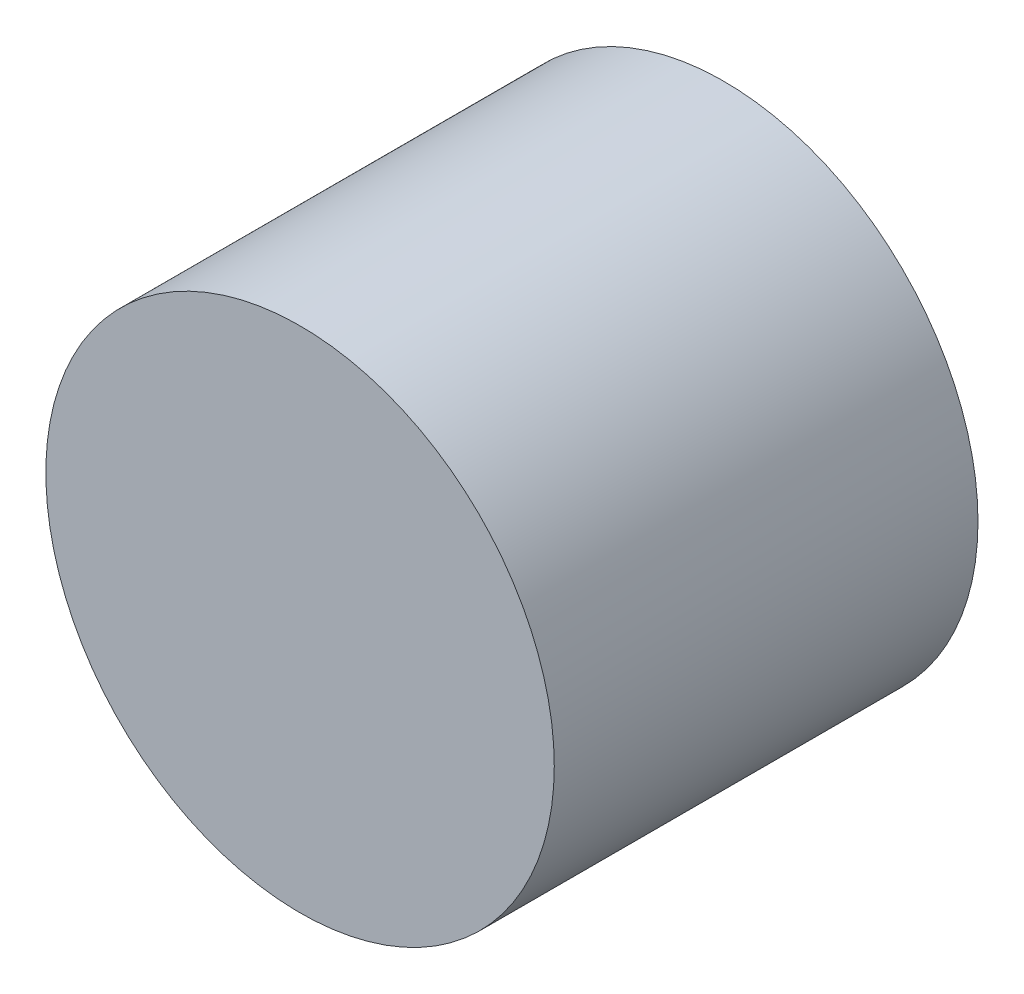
from build123d import *


with BuildPart() as part:
    # Sketch1 → Revolve1 (revolve)
    with BuildSketch(Plane(origin=(0, 0, 0), x_dir=(0, 0, -1), z_dir=(1, 0, 0)), mode=Mode.PRIVATE) as revolve1_sk:
        Polygon((-7.497848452, 2.5), (-9, 0), (-10, 0), (-10, 6), (0, 6), (0, 3), (-4.497848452, 3), (-4.497848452, 2.5), align=None)
    revolve(revolve1_sk.sketch.rotate(Axis((0, 0, 9), (0, 0, -1)), 90), axis=Axis((0, 0, 9), (0, 0, -1)))


solid = part.part
